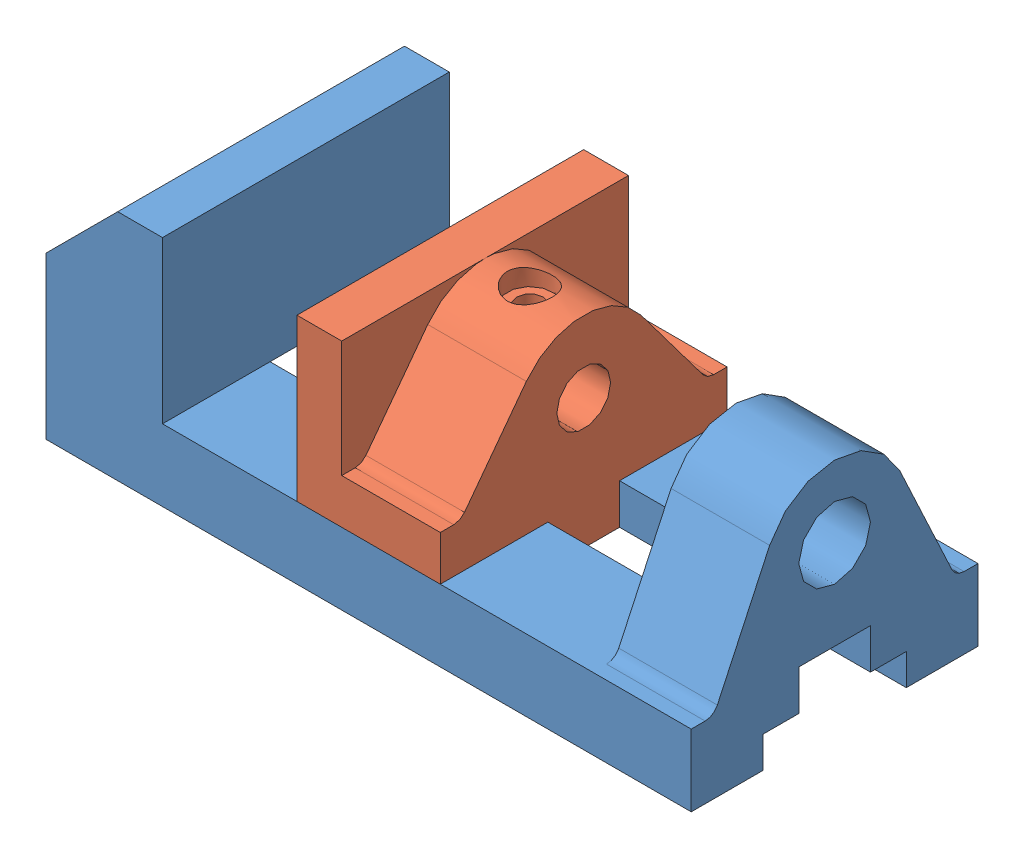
SolidWorks assembly Coincident_concentric_distance.SLDASM, configuration Default (file format 8000). Lengths in mm.
Overall size (144 52 64).
2 component instances, 2 part files, 3 mates.
Components (placement in the parent):
- vice-body-1: vice-body.SLDPRT [Default] at (-165.9369 -6.4769 36.3055) size (144 52 64)
- vice-jaw-1: vice-jaw.SLDPRT [Default] at (-109.9369 23.5231 36.3055) x (0 0 -1) z (1 0 0) size (64 45 32)
Mates (geometry in assembly coordinates):
- Coincident1: coincident aligned: plane of vice-body-1 through (-165.9369 -6.4769 68.3055) normal (0 0 1); plane of vice-jaw-1 through (-82.5369 45.5231 68.3055) normal (0 0 1)
- Concentric1: concentric aligned: cylinder of vice-body-1 through (-165.9379 29.5231 36.3055) axis (1 0 0) radius 8; cylinder of vice-jaw-1 through (-106.5369 29.5231 36.3055) axis (1 0 0) radius 6
- Distance2: distance = 30 mm anti-aligned: plane of vice-jaw-1 through (-109.9369 0.5231 4.3055) normal (-1 0 0); plane of vice-body-1 through (-139.9369 9.5231 68.3055) normal (1 0 0)
